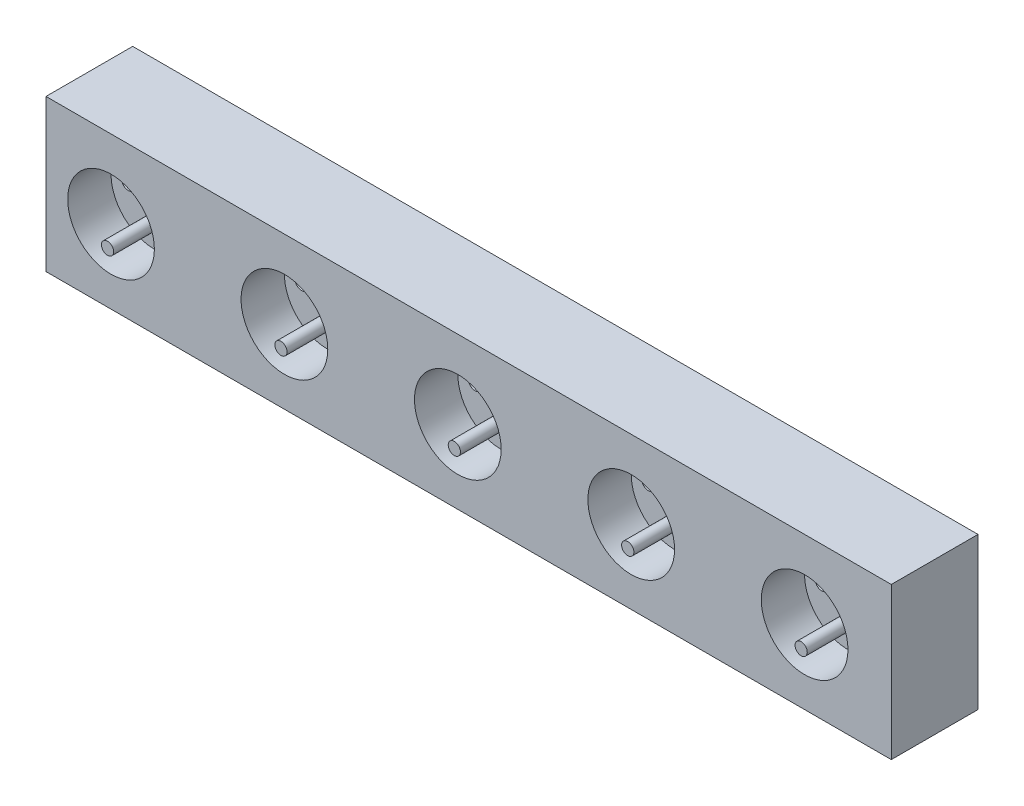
from build123d import *

# Parameters (mm, degrees)
ESQUISSE1_W                = 390
ESQUISSE1_H                = 70
EXTRUSION1_DEPTH           = 40
ESQUISSE2_R                = 20
EXTRUSION2_DEPTH           = 20
ESQUISSE3_R                = 3
EXTRUSION3_DEPTH           = 10
ESQUISSE4_R                = 2.82416304
EXTRUSION4_DEPTH           = 20
R_P_TITION_LIN_AIRE1_COUNT = 5
R_P_TITION_LIN_AIRE1_PITCH = 80


with BuildPart() as part:
    # Esquisse1 → Extrusion1 (new body)
    with BuildSketch(Plane.XY):
        with Locations((195, 35)):
            Rectangle(ESQUISSE1_W, ESQUISSE1_H)
    extrude(amount=EXTRUSION1_DEPTH)

    # Esquisse2 → Extrusion2 (cut)
    with BuildSketch(Plane.XY.offset(40)):
        with Locations((30, 33.945610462)):
            Circle(ESQUISSE2_R)
    extrusion2 = extrude(amount=-EXTRUSION2_DEPTH, mode=Mode.SUBTRACT)

    # Esquisse3 → Extrusion3 (cut)
    with BuildSketch(Plane.XY.offset(20)):
        with Locations((17.90883498, 34.376479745)):
            Circle(ESQUISSE3_R)
        with Locations((41.668468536, 33.599638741)):
            Circle(ESQUISSE3_R)
    extrusion3 = extrude(amount=-EXTRUSION3_DEPTH, mode=Mode.SUBTRACT)

    # Esquisse4 → Extrusion4 (add)
    with BuildSketch(Plane.XY.offset(20)):
        with Locations((28.402569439, 23.529340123)):
            Circle(ESQUISSE4_R)
    extrusion4 = extrude(amount=EXTRUSION4_DEPTH)

    # R_p_tition lin_aire1: Extrusion2, Extrusion3, Extrusion4 ×5
    with Locations(*[(i * R_P_TITION_LIN_AIRE1_PITCH, 0, 0) for i in range(1, R_P_TITION_LIN_AIRE1_COUNT)]):
        add(extrusion2, mode=Mode.SUBTRACT)
        add(extrusion3, mode=Mode.SUBTRACT)
        add(extrusion4)


solid = part.part
